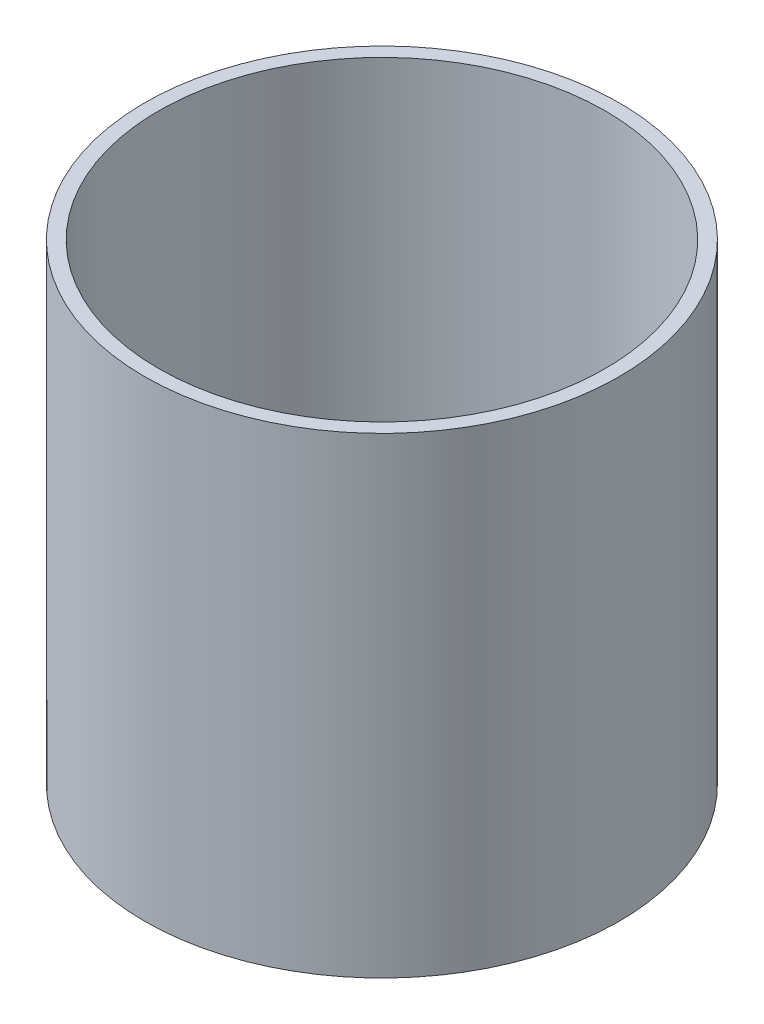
from build123d import *


with BuildPart() as part:
    # Croquis1 → Revoluci_n1 (revolve)
    with BuildSketch(Plane(origin=(0, 0, 0), x_dir=(0, 0, -1), z_dir=(1, 0, 0)), mode=Mode.PRIVATE) as revoluci_n1_sk:
        Polygon((800, 43.330104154), (800, -1626.669895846), (0, -1626.669895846), (0, -1646.669895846), (850, -1646.669895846), (850, 43.330104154), align=None)
    revolve(revoluci_n1_sk.sketch.rotate(Axis((0, 0, 0), (0, -1, 0)), 180), axis=Axis((0, 0, 0), (0, -1, 0)))


solid = part.part
